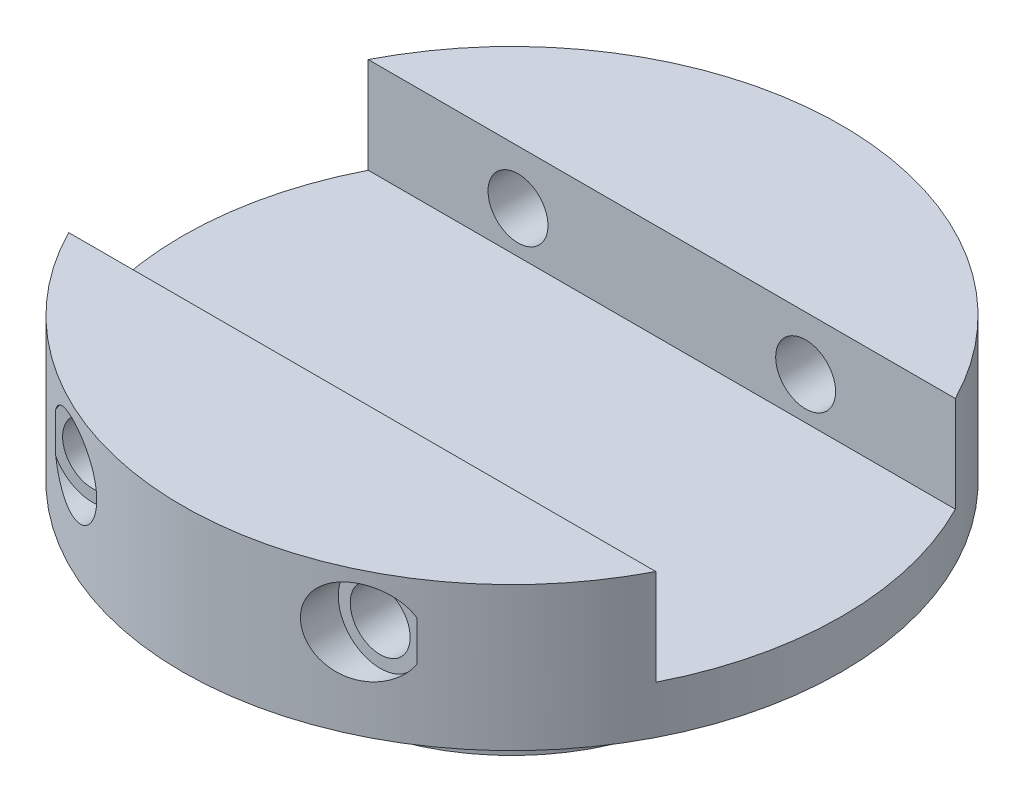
from build123d import *

# Parameters (mm, degrees)
SKETCH2_R               = 43.65625
BASE_EXTRUDE_DEPTH      = 19.05
SKETCH4_R               = 25.3619
BOSS_EXTRUDE1_DEPTH     = 13.49375
CUT_EXTRUDE1_DEPTH      = 65.611445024
CUT_EXTRUDE1_DEPTH_BACK = 65.611445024
SKETCH5_W               = 39.6875
SKETCH5_H               = 12.7
SKETCH7_R               = 3.96875
CUT_EXTRUDE2_DEPTH      = 65.611445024
SKETCH8_R               = 5.55625
CUT_EXTRUDE3_DEPTH      = 94.251268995
MIRROR2_COPY_1_SKETCH_R = 3.96875
MIRROR2_COPY_1_DEPTH    = 65.611445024
MIRROR2_COPY_2_SKETCH_R = 5.55625
MIRROR2_COPY_2_DEPTH    = 94.251268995


with BuildPart() as part:
    # Sketch2 → Base-Extrude (new body)
    with BuildSketch(Plane(origin=(0, 0, 0), x_dir=(1, 0, 0), z_dir=(0, 1, 0))):
        with Locations(Location((0, 0, 0), (0, 0, 90))):
            Circle(SKETCH2_R)
    extrude(amount=BASE_EXTRUDE_DEPTH)

    # Sketch4 → Boss-Extrude1 (add)
    with BuildSketch(Plane.XZ):
        with Locations(Location((0, 0, 0), (0, 0, 90))):
            Circle(SKETCH4_R)
    extrude(amount=BOSS_EXTRUDE1_DEPTH)

    # Sketch5 → Cut-Extrude1 (cut, two sides: drawn at the far end of the back side and taken through both)
    with BuildSketch(Plane(origin=(0, 0, 0), x_dir=(0, 0, -1), z_dir=(1, 0, 0)).offset(-CUT_EXTRUDE1_DEPTH_BACK)):
        with Locations((0, 12.7)):
            Rectangle(SKETCH5_W, SKETCH5_H)
    extrude(amount=CUT_EXTRUDE1_DEPTH + CUT_EXTRUDE1_DEPTH_BACK, mode=Mode.SUBTRACT)

    # Sketch7 → Cut-Extrude2 (cut, through all)
    with BuildSketch(Plane.XY):
        with Locations(Location((-19.05, 11.90625, 0), (0, 0, 180))):
            Circle(SKETCH7_R)
    cut_extrude2 = extrude(amount=CUT_EXTRUDE2_DEPTH, mode=Mode.SUBTRACT)

    # Sketch8 → Cut-Extrude3 (cut, through all)
    with BuildSketch(Plane.XY.offset(36.5125)):
        with Locations((-19.05, 11.90625)):
            Circle(SKETCH8_R)
    cut_extrude3 = extrude(amount=CUT_EXTRUDE3_DEPTH, mode=Mode.SUBTRACT)

    # Mirror1: Cut-Extrude2, Cut-Extrude3 across plane
    add(cut_extrude2.mirror(Plane(origin=(0, 0, 0), x_dir=(0, 0, 1), z_dir=(1, 0, 0))), mode=Mode.SUBTRACT)
    add(cut_extrude3.mirror(Plane(origin=(0, 0, 0), x_dir=(0, 0, 1), z_dir=(1, 0, 0))), mode=Mode.SUBTRACT)

    # Mirror2: Cut-Extrude2, Cut-Extrude3 across plane
    add(cut_extrude2.mirror(Plane.XY), mode=Mode.SUBTRACT)
    add(cut_extrude3.mirror(Plane.XY), mode=Mode.SUBTRACT)

    # Mirror2 copy 1 sketch → Mirror2 copy 1 (cut, through all)
    with BuildSketch(Plane(origin=(0, 0, 0), x_dir=(-1, 0, 0), z_dir=(0, 0, -1))):
        with Locations(Location((-19.05, 11.90625, 0), (0, 0, 180))):
            Circle(MIRROR2_COPY_1_SKETCH_R)
    extrude(amount=MIRROR2_COPY_1_DEPTH, mode=Mode.SUBTRACT)

    # Mirror2 copy 2 sketch → Mirror2 copy 2 (cut, through all)
    with BuildSketch(Plane(origin=(0, 0, -36.5125), x_dir=(-1, 0, 0), z_dir=(0, 0, -1))):
        with Locations((-19.05, 11.90625)):
            Circle(MIRROR2_COPY_2_SKETCH_R)
    extrude(amount=MIRROR2_COPY_2_DEPTH, mode=Mode.SUBTRACT)


solid = part.part
